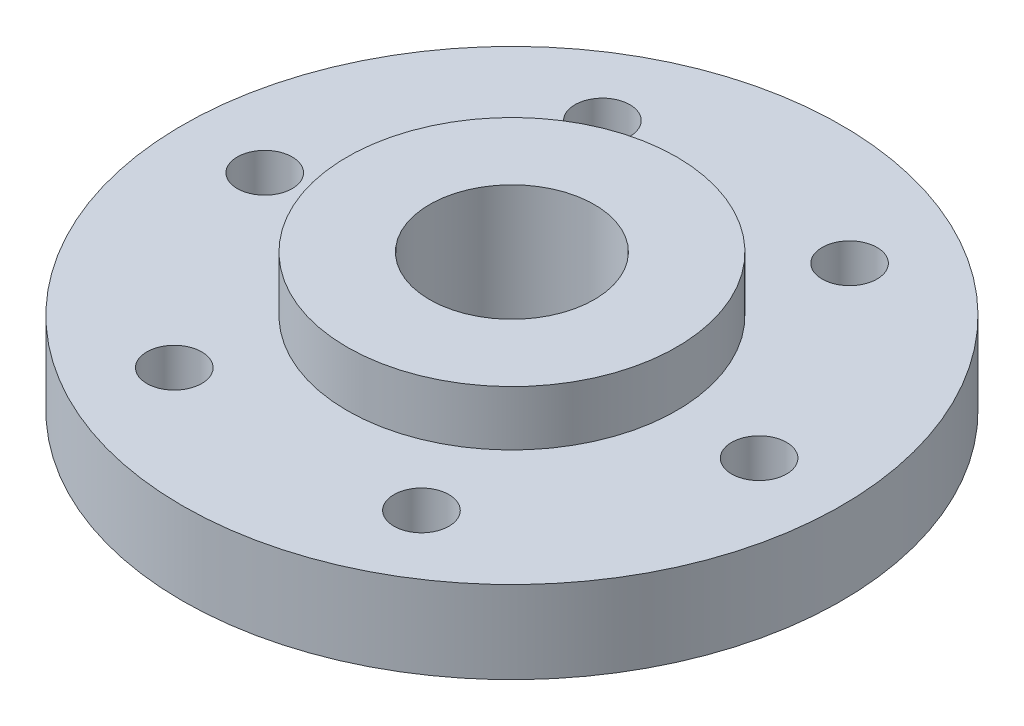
from build123d import *

# Parameters (mm, degrees)
SKETCH_1_R          = 60
EXTRUDE_1_DEPTH     = 15
SKETCH_2_R          = 30
EXTRUDE_2_DEPTH     = 10
SKETCH_3_R          = 15
CUT_EXTRUDE_1_DEPTH = 30
SKETCH_4_R          = 5
CUT_EXTRUDE_2_DEPTH = 20


with BuildPart() as part:
    # Sketch 1 → Extrude 1 (new body)
    with BuildSketch(Plane(origin=(0, 0, 0), x_dir=(1, 0, 0), z_dir=(0, 1, 0))):
        with Locations(Location((0, 0, 0), (0, 0, 270))):
            Circle(SKETCH_1_R)
    extrude(amount=EXTRUDE_1_DEPTH)

    # Sketch 2 → Extrude 2 (add)
    with BuildSketch(Plane(origin=(0, 15, 0), x_dir=(1, 0, 0), z_dir=(0, 1, 0))):
        with Locations(Location((0, 0, 0), (0, 0, 270))):
            Circle(SKETCH_2_R)
    extrude(amount=EXTRUDE_2_DEPTH)

    # Sketch 3 → Cut-Extrude 1 (cut)
    with BuildSketch(Plane(origin=(0, 0, 0), x_dir=(1, 0, 0), z_dir=(0, 1, 0))):
        with Locations(Location((0, 0, 0), (0, 0, 270))):
            Circle(SKETCH_3_R)
    extrude(amount=CUT_EXTRUDE_1_DEPTH, mode=Mode.SUBTRACT)

    # Sketch 4 → Cut-Extrude 2 (cut)
    with BuildSketch(Plane(origin=(0, 0, 0), x_dir=(1, 0, 0), z_dir=(0, 1, 0))):
        with Locations(Location((45, 0, 0), (0, 0, 270))):
            Circle(SKETCH_4_R)
        with Locations(Location((22.5, 38.97114317, 0), (0, 0, 270))):
            Circle(SKETCH_4_R)
        with Locations(Location((-22.5, 38.97114317, 0), (0, 0, 270))):
            Circle(SKETCH_4_R)
        with Locations(Location((-45, 0, 0), (0, 0, 270))):
            Circle(SKETCH_4_R)
        with Locations(Location((-22.5, -38.97114317, 0), (0, 0, 270))):
            Circle(SKETCH_4_R)
        with Locations(Location((22.5, -38.97114317, 0), (0, 0, 270))):
            Circle(SKETCH_4_R)
    extrude(amount=CUT_EXTRUDE_2_DEPTH, mode=Mode.SUBTRACT)


solid = part.part
